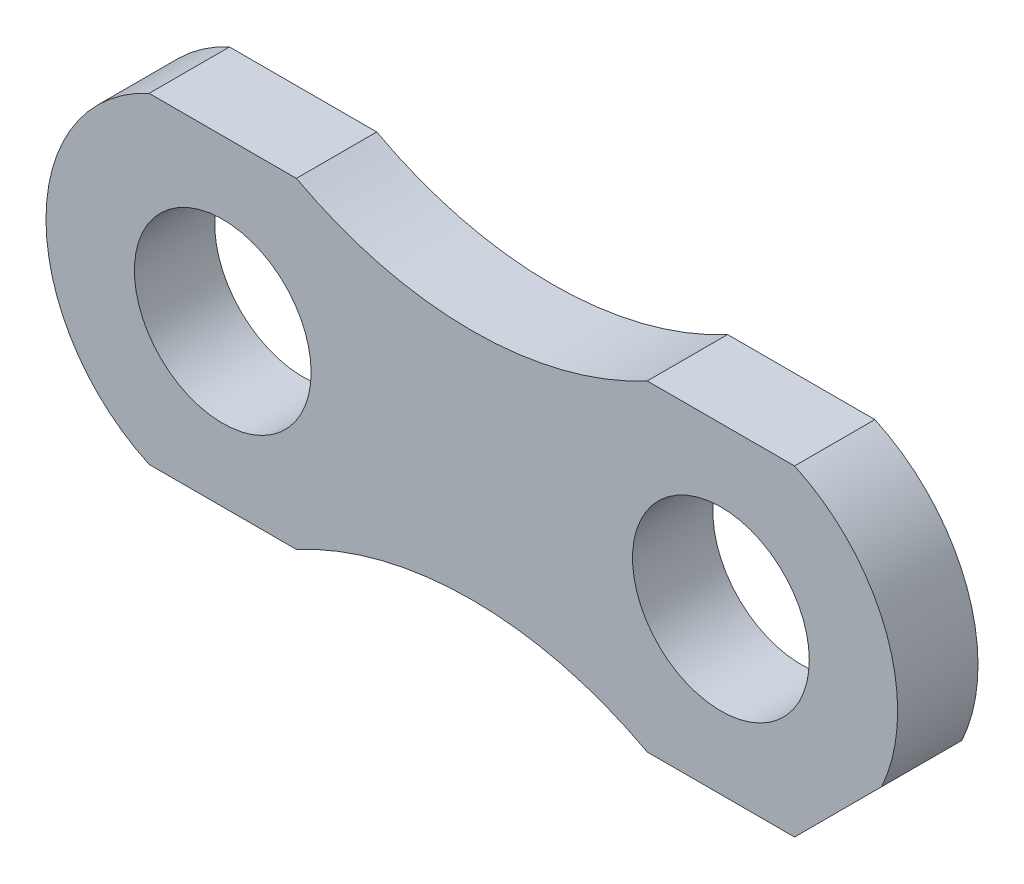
ISO-10303-21;
HEADER;
FILE_DESCRIPTION(('STEP AP214'),'2;1');
FILE_NAME('part.step','',(''),(''),'','','');
FILE_SCHEMA(('AUTOMOTIVE_DESIGN { 1 0 10303 214 1 1 1 1 }'));
ENDSEC;
DATA;
#1=APPLICATION_CONTEXT('core data for automotive mechanical design processes');
#2=APPLICATION_PROTOCOL_DEFINITION('international standard','automotive_design',2000,#1);
#3=PRODUCT_CONTEXT('',#1,'mechanical');
#4=PRODUCT('Part','Part','',(#3));
#5=PRODUCT_RELATED_PRODUCT_CATEGORY('part','',(#4));
#6=PRODUCT_DEFINITION_FORMATION('','',#4);
#7=PRODUCT_DEFINITION_CONTEXT('part definition',#1,'design');
#8=PRODUCT_DEFINITION('design','',#6,#7);
#9=PRODUCT_DEFINITION_SHAPE('','',#8);
#10=(LENGTH_UNIT() NAMED_UNIT(*) SI_UNIT(.MILLI.,.METRE.));
#11=(NAMED_UNIT(*) PLANE_ANGLE_UNIT() SI_UNIT($,.RADIAN.));
#12=(NAMED_UNIT(*) SI_UNIT($,.STERADIAN.) SOLID_ANGLE_UNIT());
#13=UNCERTAINTY_MEASURE_WITH_UNIT(LENGTH_MEASURE(1.E-05),#10,'distance_accuracy_value','');
#14=(GEOMETRIC_REPRESENTATION_CONTEXT(3) GLOBAL_UNCERTAINTY_ASSIGNED_CONTEXT((#13)) GLOBAL_UNIT_ASSIGNED_CONTEXT((#10,
#11,#12)) REPRESENTATION_CONTEXT('',''));
#15=CARTESIAN_POINT('',(0.,0.,0.));
#16=DIRECTION('',(0.,0.,1.));
#17=DIRECTION('',(1.,0.,0.));
#18=AXIS2_PLACEMENT_3D('',#15,#16,#17);
#19=CARTESIAN_POINT('',(31.,-60.5918739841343,10.));
#20=DIRECTION('',(0.,0.,-1.));
#21=DIRECTION('',(-1.,0.,0.));
#22=AXIS2_PLACEMENT_3D('',#19,#20,#21);
#23=PLANE('',#22);
#24=CARTESIAN_POINT('',(0.,0.,10.));
#25=DIRECTION('',(0.,0.,1.));
#26=DIRECTION('',(1.,0.,0.));
#27=AXIS2_PLACEMENT_3D('',#24,#25,#26);
#28=CIRCLE('',#27,11.);
#29=CARTESIAN_POINT('',(11.,0.,10.));
#30=VERTEX_POINT('',#29);
#31=EDGE_CURVE('E139',#30,#30,#28,.T.);
#32=ORIENTED_EDGE('',*,*,#31,.F.);
#33=EDGE_LOOP('',(#32));
#34=FACE_BOUND('',#33,.T.);
#35=CARTESIAN_POINT('',(31.,-60.5918739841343,10.));
#36=DIRECTION('',(0.,0.,-1.));
#37=DIRECTION('',(-1.,0.,0.));
#38=AXIS2_PLACEMENT_3D('',#35,#36,#37);
#39=CIRCLE('',#38,46.0918739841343);
#40=CARTESIAN_POINT('',(9.16515138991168,-20.,10.));
#41=VERTEX_POINT('',#40);
#42=CARTESIAN_POINT('',(52.8348486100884,-20.,10.));
#43=VERTEX_POINT('',#42);
#44=EDGE_CURVE('E152',#41,#43,#39,.T.);
#45=ORIENTED_EDGE('',*,*,#44,.T.);
#46=DIRECTION('',(1.,0.,0.));
#47=VECTOR('',#46,1.);
#48=CARTESIAN_POINT('',(52.8348486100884,-20.,10.));
#49=LINE('',#48,#47);
#50=CARTESIAN_POINT('',(71.1651513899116,-20.,10.));
#51=VERTEX_POINT('',#50);
#52=EDGE_CURVE('E95',#43,#51,#49,.T.);
#53=ORIENTED_EDGE('',*,*,#52,.T.);
#54=DIRECTION('',(0.707106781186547,0.707106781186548,0.));
#55=VECTOR('',#54,1.);
#56=CARTESIAN_POINT('',(71.1651513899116,-20.,10.));
#57=LINE('',#56,#55);
#58=CARTESIAN_POINT('',(82.,-9.1651513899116,10.));
#59=VERTEX_POINT('',#58);
#60=EDGE_CURVE('E170',#51,#59,#57,.T.);
#61=ORIENTED_EDGE('',*,*,#60,.T.);
#62=CARTESIAN_POINT('',(62.,0.,10.));
#63=DIRECTION('',(0.,0.,1.));
#64=DIRECTION('',(1.,0.,0.));
#65=AXIS2_PLACEMENT_3D('',#62,#63,#64);
#66=CIRCLE('',#65,22.);
#67=CARTESIAN_POINT('',(71.1651513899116,20.,10.));
#68=VERTEX_POINT('',#67);
#69=EDGE_CURVE('E187',#59,#68,#66,.T.);
#70=ORIENTED_EDGE('',*,*,#69,.T.);
#71=DIRECTION('',(-1.,0.,0.));
#72=VECTOR('',#71,1.);
#73=CARTESIAN_POINT('',(52.8348486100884,20.,10.));
#74=LINE('',#73,#72);
#75=CARTESIAN_POINT('',(52.8348486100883,20.,10.));
#76=VERTEX_POINT('',#75);
#77=EDGE_CURVE('E186',#68,#76,#74,.T.);
#78=ORIENTED_EDGE('',*,*,#77,.T.);
#79=CARTESIAN_POINT('',(31.,60.5918739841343,10.));
#80=DIRECTION('',(0.,0.,-1.));
#81=DIRECTION('',(1.,0.,0.));
#82=AXIS2_PLACEMENT_3D('',#79,#80,#81);
#83=CIRCLE('',#82,46.0918739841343);
#84=CARTESIAN_POINT('',(9.16515138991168,20.,10.));
#85=VERTEX_POINT('',#84);
#86=EDGE_CURVE('E117',#76,#85,#83,.T.);
#87=ORIENTED_EDGE('',*,*,#86,.T.);
#88=DIRECTION('',(-1.,0.,0.));
#89=VECTOR('',#88,1.);
#90=CARTESIAN_POINT('',(-9.16515138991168,20.,10.));
#91=LINE('',#90,#89);
#92=CARTESIAN_POINT('',(-9.16515138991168,20.,10.));
#93=VERTEX_POINT('',#92);
#94=EDGE_CURVE('E111',#85,#93,#91,.T.);
#95=ORIENTED_EDGE('',*,*,#94,.T.);
#96=CARTESIAN_POINT('',(0.,0.,10.));
#97=DIRECTION('',(0.,0.,1.));
#98=DIRECTION('',(1.,0.,0.));
#99=AXIS2_PLACEMENT_3D('',#96,#97,#98);
#100=CIRCLE('',#99,22.);
#101=CARTESIAN_POINT('',(-9.16515138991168,-20.,10.));
#102=VERTEX_POINT('',#101);
#103=EDGE_CURVE('E115',#93,#102,#100,.T.);
#104=ORIENTED_EDGE('',*,*,#103,.T.);
#105=DIRECTION('',(1.,0.,0.));
#106=VECTOR('',#105,1.);
#107=CARTESIAN_POINT('',(-9.16515138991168,-20.,10.));
#108=LINE('',#107,#106);
#109=EDGE_CURVE('E49',#102,#41,#108,.T.);
#110=ORIENTED_EDGE('',*,*,#109,.T.);
#111=EDGE_LOOP('',(#45,#53,#61,#70,#78,#87,#95,#104,#110));
#112=FACE_BOUND('',#111,.T.);
#113=CARTESIAN_POINT('',(62.,0.,10.));
#114=DIRECTION('',(0.,0.,1.));
#115=DIRECTION('',(1.,0.,0.));
#116=AXIS2_PLACEMENT_3D('',#113,#114,#115);
#117=CIRCLE('',#116,11.);
#118=CARTESIAN_POINT('',(73.,0.,10.));
#119=VERTEX_POINT('',#118);
#120=EDGE_CURVE('E197',#119,#119,#117,.T.);
#121=ORIENTED_EDGE('',*,*,#120,.F.);
#122=EDGE_LOOP('',(#121));
#123=FACE_BOUND('',#122,.T.);
#124=ADVANCED_FACE('F32',(#34,#112,#123),#23,.F.);
#125=CARTESIAN_POINT('',(31.,-60.5918739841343,0.));
#126=DIRECTION('',(0.,0.,-1.));
#127=DIRECTION('',(-1.,0.,0.));
#128=AXIS2_PLACEMENT_3D('',#125,#126,#127);
#129=PLANE('',#128);
#130=CARTESIAN_POINT('',(0.,0.,0.));
#131=DIRECTION('',(0.,0.,1.));
#132=DIRECTION('',(1.,0.,0.));
#133=AXIS2_PLACEMENT_3D('',#130,#131,#132);
#134=CIRCLE('',#133,11.);
#135=CARTESIAN_POINT('',(11.,0.,0.));
#136=VERTEX_POINT('',#135);
#137=EDGE_CURVE('E194',#136,#136,#134,.T.);
#138=ORIENTED_EDGE('',*,*,#137,.T.);
#139=EDGE_LOOP('',(#138));
#140=FACE_BOUND('',#139,.T.);
#141=CARTESIAN_POINT('',(31.,-60.5918739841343,0.));
#142=DIRECTION('',(0.,0.,-1.));
#143=DIRECTION('',(-1.,0.,0.));
#144=AXIS2_PLACEMENT_3D('',#141,#142,#143);
#145=CIRCLE('',#144,46.0918739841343);
#146=CARTESIAN_POINT('',(9.16515138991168,-20.,0.));
#147=VERTEX_POINT('',#146);
#148=CARTESIAN_POINT('',(52.8348486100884,-20.,0.));
#149=VERTEX_POINT('',#148);
#150=EDGE_CURVE('E135',#147,#149,#145,.T.);
#151=ORIENTED_EDGE('',*,*,#150,.F.);
#152=DIRECTION('',(1.,0.,0.));
#153=VECTOR('',#152,1.);
#154=CARTESIAN_POINT('',(-9.16515138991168,-20.,0.));
#155=LINE('',#154,#153);
#156=CARTESIAN_POINT('',(-9.16515138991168,-20.,0.));
#157=VERTEX_POINT('',#156);
#158=EDGE_CURVE('E87',#157,#147,#155,.T.);
#159=ORIENTED_EDGE('',*,*,#158,.F.);
#160=CARTESIAN_POINT('',(0.,0.,0.));
#161=DIRECTION('',(0.,0.,1.));
#162=DIRECTION('',(1.,0.,0.));
#163=AXIS2_PLACEMENT_3D('',#160,#161,#162);
#164=CIRCLE('',#163,22.);
#165=CARTESIAN_POINT('',(-9.16515138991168,20.,0.));
#166=VERTEX_POINT('',#165);
#167=EDGE_CURVE('E81',#166,#157,#164,.T.);
#168=ORIENTED_EDGE('',*,*,#167,.F.);
#169=DIRECTION('',(-1.,0.,0.));
#170=VECTOR('',#169,1.);
#171=CARTESIAN_POINT('',(-9.16515138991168,20.,0.));
#172=LINE('',#171,#170);
#173=CARTESIAN_POINT('',(9.16515138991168,20.,0.));
#174=VERTEX_POINT('',#173);
#175=EDGE_CURVE('E125',#174,#166,#172,.T.);
#176=ORIENTED_EDGE('',*,*,#175,.F.);
#177=CARTESIAN_POINT('',(31.,60.5918739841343,0.));
#178=DIRECTION('',(0.,0.,-1.));
#179=DIRECTION('',(1.,0.,0.));
#180=AXIS2_PLACEMENT_3D('',#177,#178,#179);
#181=CIRCLE('',#180,46.0918739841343);
#182=CARTESIAN_POINT('',(52.8348486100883,20.,0.));
#183=VERTEX_POINT('',#182);
#184=EDGE_CURVE('E147',#183,#174,#181,.T.);
#185=ORIENTED_EDGE('',*,*,#184,.F.);
#186=DIRECTION('',(-1.,0.,0.));
#187=VECTOR('',#186,1.);
#188=CARTESIAN_POINT('',(52.8348486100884,20.,0.));
#189=LINE('',#188,#187);
#190=CARTESIAN_POINT('',(71.1651513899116,20.,0.));
#191=VERTEX_POINT('',#190);
#192=EDGE_CURVE('E145',#191,#183,#189,.T.);
#193=ORIENTED_EDGE('',*,*,#192,.F.);
#194=CARTESIAN_POINT('',(62.,0.,0.));
#195=DIRECTION('',(0.,0.,1.));
#196=DIRECTION('',(1.,0.,0.));
#197=AXIS2_PLACEMENT_3D('',#194,#195,#196);
#198=CIRCLE('',#197,22.);
#199=CARTESIAN_POINT('',(82.,-9.1651513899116,0.));
#200=VERTEX_POINT('',#199);
#201=EDGE_CURVE('E143',#200,#191,#198,.T.);
#202=ORIENTED_EDGE('',*,*,#201,.F.);
#203=DIRECTION('',(0.707106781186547,0.707106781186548,0.));
#204=VECTOR('',#203,1.);
#205=CARTESIAN_POINT('',(71.1651513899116,-20.,0.));
#206=LINE('',#205,#204);
#207=CARTESIAN_POINT('',(71.1651513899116,-20.,0.));
#208=VERTEX_POINT('',#207);
#209=EDGE_CURVE('E141',#208,#200,#206,.T.);
#210=ORIENTED_EDGE('',*,*,#209,.F.);
#211=DIRECTION('',(1.,0.,0.));
#212=VECTOR('',#211,1.);
#213=CARTESIAN_POINT('',(52.8348486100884,-20.,0.));
#214=LINE('',#213,#212);
#215=EDGE_CURVE('E138',#149,#208,#214,.T.);
#216=ORIENTED_EDGE('',*,*,#215,.F.);
#217=EDGE_LOOP('',(#151,#159,#168,#176,#185,#193,#202,#210,#216));
#218=FACE_BOUND('',#217,.T.);
#219=CARTESIAN_POINT('',(62.,0.,0.));
#220=DIRECTION('',(0.,0.,1.));
#221=DIRECTION('',(1.,0.,0.));
#222=AXIS2_PLACEMENT_3D('',#219,#220,#221);
#223=CIRCLE('',#222,11.);
#224=CARTESIAN_POINT('',(73.,0.,0.));
#225=VERTEX_POINT('',#224);
#226=EDGE_CURVE('E200',#225,#225,#223,.T.);
#227=ORIENTED_EDGE('',*,*,#226,.T.);
#228=EDGE_LOOP('',(#227));
#229=FACE_BOUND('',#228,.T.);
#230=ADVANCED_FACE('F174',(#140,#218,#229),#129,.T.);
#231=CARTESIAN_POINT('',(31.,-60.5918739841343,10.));
#232=DIRECTION('',(0.,0.,-1.));
#233=DIRECTION('',(-1.,0.,0.));
#234=AXIS2_PLACEMENT_3D('',#231,#232,#233);
#235=CYLINDRICAL_SURFACE('',#234,46.0918739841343);
#236=ORIENTED_EDGE('',*,*,#150,.T.);
#237=DIRECTION('',(0.,0.,-1.));
#238=VECTOR('',#237,1.);
#239=CARTESIAN_POINT('',(52.8348486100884,-20.,10.));
#240=LINE('',#239,#238);
#241=EDGE_CURVE('E11',#43,#149,#240,.T.);
#242=ORIENTED_EDGE('',*,*,#241,.F.);
#243=ORIENTED_EDGE('',*,*,#44,.F.);
#244=DIRECTION('',(0.,0.,-1.));
#245=VECTOR('',#244,1.);
#246=CARTESIAN_POINT('',(9.16515138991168,-20.,10.));
#247=LINE('',#246,#245);
#248=EDGE_CURVE('E131',#41,#147,#247,.T.);
#249=ORIENTED_EDGE('',*,*,#248,.T.);
#250=EDGE_LOOP('',(#236,#242,#243,#249));
#251=FACE_BOUND('',#250,.T.);
#252=ADVANCED_FACE('F34',(#251),#235,.F.);
#253=CARTESIAN_POINT('',(52.8348486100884,-20.,10.));
#254=DIRECTION('',(0.,1.,0.));
#255=DIRECTION('',(0.,0.,1.));
#256=AXIS2_PLACEMENT_3D('',#253,#254,#255);
#257=PLANE('',#256);
#258=ORIENTED_EDGE('',*,*,#215,.T.);
#259=DIRECTION('',(0.,0.,-1.));
#260=VECTOR('',#259,1.);
#261=CARTESIAN_POINT('',(71.1651513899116,-20.,10.));
#262=LINE('',#261,#260);
#263=EDGE_CURVE('E41',#51,#208,#262,.T.);
#264=ORIENTED_EDGE('',*,*,#263,.F.);
#265=ORIENTED_EDGE('',*,*,#52,.F.);
#266=ORIENTED_EDGE('',*,*,#241,.T.);
#267=EDGE_LOOP('',(#258,#264,#265,#266));
#268=FACE_BOUND('',#267,.T.);
#269=ADVANCED_FACE('F237',(#268),#257,.F.);
#270=CARTESIAN_POINT('',(71.1651513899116,-20.,10.));
#271=DIRECTION('',(-0.707106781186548,0.707106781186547,0.));
#272=DIRECTION('',(-0.707106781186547,-0.707106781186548,0.));
#273=AXIS2_PLACEMENT_3D('',#270,#271,#272);
#274=PLANE('',#273);
#275=ORIENTED_EDGE('',*,*,#209,.T.);
#276=DIRECTION('',(0.,0.,-1.));
#277=VECTOR('',#276,1.);
#278=CARTESIAN_POINT('',(82.,-9.1651513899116,10.));
#279=LINE('',#278,#277);
#280=EDGE_CURVE('E162',#59,#200,#279,.T.);
#281=ORIENTED_EDGE('',*,*,#280,.F.);
#282=ORIENTED_EDGE('',*,*,#60,.F.);
#283=ORIENTED_EDGE('',*,*,#263,.T.);
#284=EDGE_LOOP('',(#275,#281,#282,#283));
#285=FACE_BOUND('',#284,.T.);
#286=ADVANCED_FACE('F168',(#285),#274,.F.);
#287=CARTESIAN_POINT('',(62.,0.,10.));
#288=DIRECTION('',(0.,0.,-1.));
#289=DIRECTION('',(-1.,0.,0.));
#290=AXIS2_PLACEMENT_3D('',#287,#288,#289);
#291=CYLINDRICAL_SURFACE('',#290,22.);
#292=ORIENTED_EDGE('',*,*,#201,.T.);
#293=DIRECTION('',(0.,0.,-1.));
#294=VECTOR('',#293,1.);
#295=CARTESIAN_POINT('',(71.1651513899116,20.,10.));
#296=LINE('',#295,#294);
#297=EDGE_CURVE('E159',#68,#191,#296,.T.);
#298=ORIENTED_EDGE('',*,*,#297,.F.);
#299=ORIENTED_EDGE('',*,*,#69,.F.);
#300=ORIENTED_EDGE('',*,*,#280,.T.);
#301=EDGE_LOOP('',(#292,#298,#299,#300));
#302=FACE_BOUND('',#301,.T.);
#303=ADVANCED_FACE('F180',(#302),#291,.T.);
#304=CARTESIAN_POINT('',(52.8348486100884,20.,10.));
#305=DIRECTION('',(0.,-1.,0.));
#306=DIRECTION('',(0.,0.,-1.));
#307=AXIS2_PLACEMENT_3D('',#304,#305,#306);
#308=PLANE('',#307);
#309=ORIENTED_EDGE('',*,*,#192,.T.);
#310=DIRECTION('',(0.,0.,-1.));
#311=VECTOR('',#310,1.);
#312=CARTESIAN_POINT('',(52.8348486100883,20.,10.));
#313=LINE('',#312,#311);
#314=EDGE_CURVE('E156',#76,#183,#313,.T.);
#315=ORIENTED_EDGE('',*,*,#314,.F.);
#316=ORIENTED_EDGE('',*,*,#77,.F.);
#317=ORIENTED_EDGE('',*,*,#297,.T.);
#318=EDGE_LOOP('',(#309,#315,#316,#317));
#319=FACE_BOUND('',#318,.T.);
#320=ADVANCED_FACE('F184',(#319),#308,.F.);
#321=CARTESIAN_POINT('',(31.,60.5918739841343,10.));
#322=DIRECTION('',(0.,0.,-1.));
#323=DIRECTION('',(-1.,0.,0.));
#324=AXIS2_PLACEMENT_3D('',#321,#322,#323);
#325=CYLINDRICAL_SURFACE('',#324,46.0918739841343);
#326=ORIENTED_EDGE('',*,*,#184,.T.);
#327=DIRECTION('',(0.,0.,-1.));
#328=VECTOR('',#327,1.);
#329=CARTESIAN_POINT('',(9.16515138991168,20.,10.));
#330=LINE('',#329,#328);
#331=EDGE_CURVE('E126',#85,#174,#330,.T.);
#332=ORIENTED_EDGE('',*,*,#331,.F.);
#333=ORIENTED_EDGE('',*,*,#86,.F.);
#334=ORIENTED_EDGE('',*,*,#314,.T.);
#335=EDGE_LOOP('',(#326,#332,#333,#334));
#336=FACE_BOUND('',#335,.T.);
#337=ADVANCED_FACE('F228',(#336),#325,.F.);
#338=CARTESIAN_POINT('',(-9.16515138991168,20.,10.));
#339=DIRECTION('',(0.,-1.,0.));
#340=DIRECTION('',(0.,0.,-1.));
#341=AXIS2_PLACEMENT_3D('',#338,#339,#340);
#342=PLANE('',#341);
#343=ORIENTED_EDGE('',*,*,#175,.T.);
#344=DIRECTION('',(0.,0.,-1.));
#345=VECTOR('',#344,1.);
#346=CARTESIAN_POINT('',(-9.16515138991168,20.,10.));
#347=LINE('',#346,#345);
#348=EDGE_CURVE('E122',#93,#166,#347,.T.);
#349=ORIENTED_EDGE('',*,*,#348,.F.);
#350=ORIENTED_EDGE('',*,*,#94,.F.);
#351=ORIENTED_EDGE('',*,*,#331,.T.);
#352=EDGE_LOOP('',(#343,#349,#350,#351));
#353=FACE_BOUND('',#352,.T.);
#354=ADVANCED_FACE('F123',(#353),#342,.F.);
#355=CARTESIAN_POINT('',(0.,0.,10.));
#356=DIRECTION('',(0.,0.,-1.));
#357=DIRECTION('',(-1.,0.,0.));
#358=AXIS2_PLACEMENT_3D('',#355,#356,#357);
#359=CYLINDRICAL_SURFACE('',#358,22.);
#360=ORIENTED_EDGE('',*,*,#167,.T.);
#361=DIRECTION('',(0.,0.,-1.));
#362=VECTOR('',#361,1.);
#363=CARTESIAN_POINT('',(-9.16515138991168,-20.,10.));
#364=LINE('',#363,#362);
#365=EDGE_CURVE('E127',#102,#157,#364,.T.);
#366=ORIENTED_EDGE('',*,*,#365,.F.);
#367=ORIENTED_EDGE('',*,*,#103,.F.);
#368=ORIENTED_EDGE('',*,*,#348,.T.);
#369=EDGE_LOOP('',(#360,#366,#367,#368));
#370=FACE_BOUND('',#369,.T.);
#371=ADVANCED_FACE('F129',(#370),#359,.T.);
#372=CARTESIAN_POINT('',(-9.16515138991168,-20.,10.));
#373=DIRECTION('',(0.,1.,0.));
#374=DIRECTION('',(0.,0.,1.));
#375=AXIS2_PLACEMENT_3D('',#372,#373,#374);
#376=PLANE('',#375);
#377=ORIENTED_EDGE('',*,*,#158,.T.);
#378=ORIENTED_EDGE('',*,*,#248,.F.);
#379=ORIENTED_EDGE('',*,*,#109,.F.);
#380=ORIENTED_EDGE('',*,*,#365,.T.);
#381=EDGE_LOOP('',(#377,#378,#379,#380));
#382=FACE_BOUND('',#381,.T.);
#383=ADVANCED_FACE('F221',(#382),#376,.F.);
#384=CARTESIAN_POINT('',(0.,0.,10.));
#385=DIRECTION('',(0.,0.,-1.));
#386=DIRECTION('',(-1.,0.,0.));
#387=AXIS2_PLACEMENT_3D('',#384,#385,#386);
#388=CYLINDRICAL_SURFACE('',#387,11.);
#389=ORIENTED_EDGE('',*,*,#31,.T.);
#390=EDGE_LOOP('',(#389));
#391=FACE_BOUND('',#390,.T.);
#392=ORIENTED_EDGE('',*,*,#137,.F.);
#393=EDGE_LOOP('',(#392));
#394=FACE_BOUND('',#393,.T.);
#395=ADVANCED_FACE('F218',(#391,#394),#388,.F.);
#396=CARTESIAN_POINT('',(62.,0.,10.));
#397=DIRECTION('',(0.,0.,-1.));
#398=DIRECTION('',(-1.,0.,0.));
#399=AXIS2_PLACEMENT_3D('',#396,#397,#398);
#400=CYLINDRICAL_SURFACE('',#399,11.);
#401=ORIENTED_EDGE('',*,*,#120,.T.);
#402=EDGE_LOOP('',(#401));
#403=FACE_BOUND('',#402,.T.);
#404=ORIENTED_EDGE('',*,*,#226,.F.);
#405=EDGE_LOOP('',(#404));
#406=FACE_BOUND('',#405,.T.);
#407=ADVANCED_FACE('F206',(#403,#406),#400,.F.);
#408=CLOSED_SHELL('',(#124,#230,#252,#269,#286,#303,#320,#337,#354,#371,#383,#395,#407));
#409=MANIFOLD_SOLID_BREP('B2',#408);
#410=ADVANCED_BREP_SHAPE_REPRESENTATION('',(#18,#409),#14);
#411=SHAPE_DEFINITION_REPRESENTATION(#9,#410);
ENDSEC;
END-ISO-10303-21;
